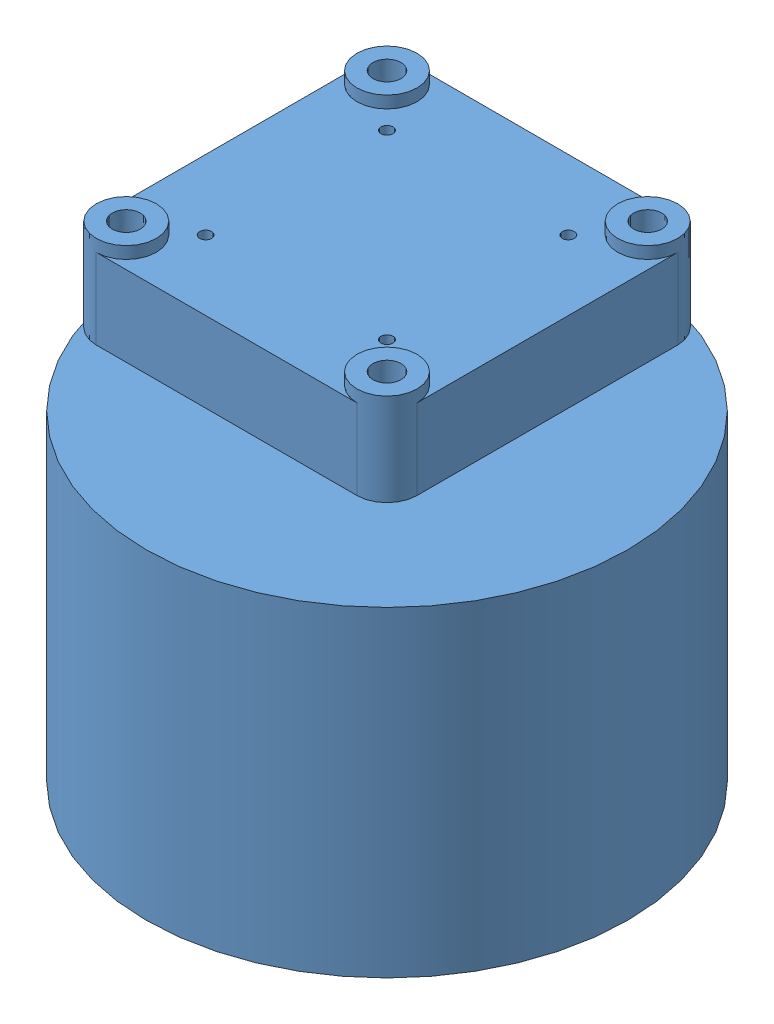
SolidWorks assembly AssemWithBrackets.SLDASM, configuration Default (file format 15000). Lengths in mm.
Overall size (120 122.5 167.22).
5 component instances, 3 part files, 10 mates.
Components (placement in the parent):
- bracketGimbal-3: bracketGimbal.SLDPRT [Default] at (-4.2647 -34.9382 23.7279) x (-1 0 0) z (0 0 1) size (21.8 61.92 149.16)
- gimbalModelApprox-1: gimbalModelApprox.SLDPRT [Default] at (1.0363 -59.4382 23.7279) size (120 121 120)
- bracketGimbal-5: bracketGimbal.SLDPRT [Default] at (6.3374 -34.9382 23.7279) x (1 0 0) z (0 0 -1) size (21.8 61.92 149.16)
- bracketGimbalwithoutAttach-1: bracketGimbalwithoutAttach.SLDPRT [Default] at (6.3374 -41.9382 23.7871) size (14.8 30.84 167.16)
- bracketGimbalwithoutAttach-2: bracketGimbalwithoutAttach.SLDPRT [Default] at (-19.0647 -41.9382 23.7279) size (14.8 30.84 167.16)
Mates (geometry in assembly coordinates):
- Coincident9: coincident anti-aligned: plane of bracketGimbal-3 through (-19.0647 -39.4382 113.7279) normal (0 -1 0); plane of gimbalModelApprox-1 through (-31.4637 -39.4382 56.2279) normal (0 1 0)
- Concentric2: concentric anti-aligned: cylinder of bracketGimbal-3 through (-21.5642 -42.9382 46.3284) axis (0 1 0) radius 1.5; cylinder of gimbalModelApprox-1 through (-21.5642 -39.4382 46.3284) axis (0 -1 0) radius 1.5
- Concentric4: concentric anti-aligned: cylinder of bracketGimbal-3 through (-21.5642 -42.9382 1.1274) axis (0 1 0) radius 1.5; cylinder of gimbalModelApprox-1 through (-21.5642 -39.4382 1.1274) axis (0 -1 0) radius 1.5
- Coincident10: coincident anti-aligned: plane of gimbalModelApprox-1 through (-31.4637 -39.4382 56.2279) normal (0 1 0); plane of bracketGimbal-5 through (21.1374 -39.4382 -66.2721) normal (0 -1 0)
- Concentric5: concentric anti-aligned: cylinder of gimbalModelApprox-1 through (23.6369 -39.4382 1.1274) axis (0 -1 0) radius 1.5; cylinder of bracketGimbal-5 through (23.6369 -42.9382 1.1274) axis (0 1 0) radius 1.5
- Concentric6: concentric anti-aligned: line of gimbalModelApprox-1 through (23.6369 -39.4382 46.3284) axis (0 -1 0); axis of bracketGimbal-5 through (23.6369 -39.4382 46.3284) axis (0 1 0)
- Concentric7: concentric aligned: cylinder of bracketGimbal-3 through (-11.6647 -70.7382 -66.2721) axis (0 0 1) radius 2; cylinder of bracketGimbalwithoutAttach-2 through (-11.6647 -70.7382 -66.2721) axis (0 0 1) radius 2
- Concentric8: concentric aligned: cylinder of bracketGimbal-3 through (-11.6647 -92.1382 -66.2721) axis (0 0 1) radius 2; cylinder of bracketGimbalwithoutAttach-2 through (-11.6647 -92.1382 -66.2721) axis (0 0 1) radius 2
- Concentric9: concentric anti-aligned: cylinder of bracketGimbal-5 through (13.7374 -92.1382 113.7279) axis (0 0 -1) radius 2; cylinder of bracketGimbalwithoutAttach-1 through (13.7374 -92.1382 -66.2129) axis (0 0 1) radius 2
- Concentric10: concentric anti-aligned: cylinder of bracketGimbal-5 through (13.7374 -70.7382 113.7279) axis (0 0 -1) radius 2; cylinder of bracketGimbalwithoutAttach-1 through (13.7374 -70.7382 -66.2129) axis (0 0 1) radius 2
